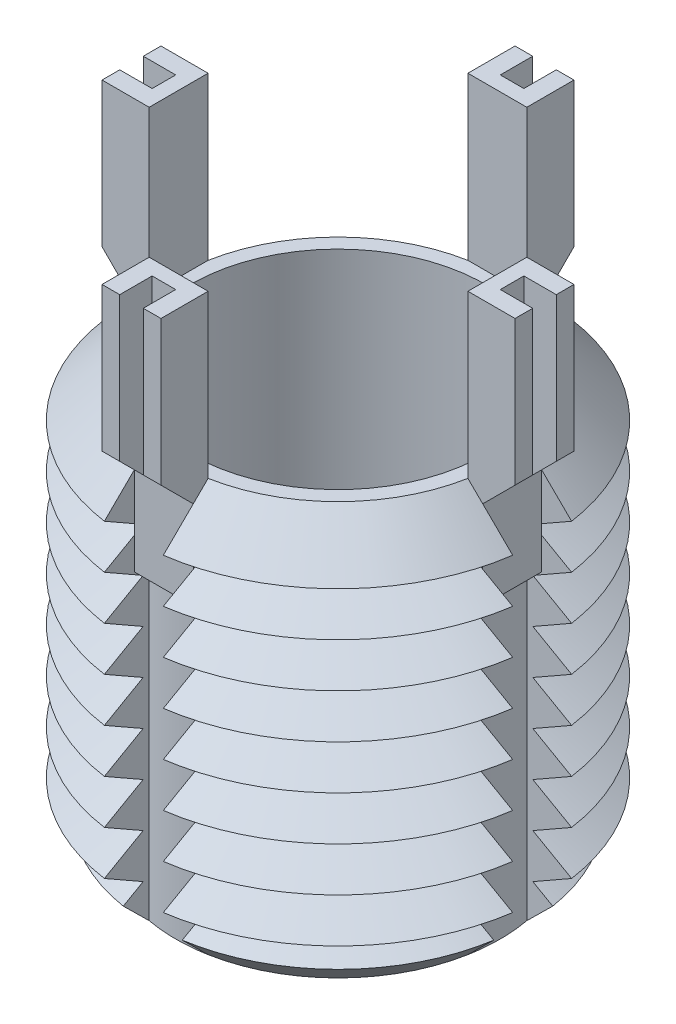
from build123d import *

# Parameters (mm, degrees)
SKETCH1_R               = 7
BOSS_EXTRUDE1_DEPTH     = 14
CHAMFER1_SIZE           = 1.5
LPATTERN1_COUNT         = 8
LPATTERN1_PITCH         = 1.5
CUT_EXTRUDE1_REACH      = 19.146
CIRPATTERN1_COUNT       = 4
BOSS_EXTRUDE3_DEPTH     = 1
CIRPATTERN2_COUNT       = 4
CUT_EXTRUDE3_DEPTH      = 22.874261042
CUT_EXTRUDE3_DEPTH_BACK = 22.874261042
SKETCH6_W               = 1.1
SKETCH6_H               = 0.8
SKETCH6_W_2             = 0.8
SKETCH6_H_2             = 1.1
SKETCH7_R               = 5
CUT_EXTRUDE4_DEPTH      = 14


with BuildPart() as part:
    # Sketch1 → Boss-Extrude1 (new body)
    with BuildSketch(Plane(origin=(0, 0, 0), x_dir=(1, 0, 0), z_dir=(0, 1, 0))):
        with Locations(Location((0, 0, 0), (0, 0, 270))):
            Circle(SKETCH1_R)
    extrude(amount=-BOSS_EXTRUDE1_DEPTH)

    # Chamfer1
    chamfer1_edges = [part.edges().sort_by_distance(p)[0] for p in [
        (0, 0, -7),
        (0, -14, -7),
    ]]
    chamfer(chamfer1_edges, length=CHAMFER1_SIZE)

    # Sketch3 → Cut-Revolve1 (revolve, cut)
    with BuildSketch(Plane(origin=(0, 0, 0), x_dir=(0, 0, -1), z_dir=(1, 0, 0))):
        Polygon((-7, -1.5), (-5.700961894, -2.25), (-7, -3), align=None)
    cut_revolve1 = revolve(axis=Axis((0, 0.885892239, 0), (0, -1, 0)), mode=Mode.SUBTRACT)

    # LPattern1: Cut-Revolve1 ×8
    with Locations(*[(0, -i * LPATTERN1_PITCH, 0) for i in range(1, LPATTERN1_COUNT)]):
        add(cut_revolve1, mode=Mode.SUBTRACT)

    # Cut-Extrude1: up to this cone (the profile starts inside it)
    cut_extrude1_end = Plane(origin=(0, 0, 0), z_dir=(0, 1, 0)).offset(-19.499999) * Cone(1e-06, 58.646, 58.645999, align=(Align.CENTER, Align.CENTER, Align.MIN), mode=Mode.PRIVATE)
    # Sketch4 → Cut-Extrude1 (cut, up to the surface)
    with BuildSketch(Plane(origin=(0, 0, 0), x_dir=(1, 0, 0), z_dir=(0, 1, 0)), mode=Mode.PRIVATE) as cut_extrude1_sk1:
        with BuildLine():
            Line((-5.408326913, 1), (-6.92820323, 1))
            ThreePointArc((-6.92820323, 1), (-7, 0), (-6.92820323, -1))
            Line((-6.92820323, -1), (-5.408326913, -1))
            ThreePointArc((-5.408326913, -1), (-5.5, 0), (-5.408326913, 1))
        make_face()
    cut_extrude1_tool1 = extrude(cut_extrude1_sk1.sketch, amount=-CUT_EXTRUDE1_REACH, mode=Mode.PRIVATE) & cut_extrude1_end
    cut_extrude1 = cut_extrude1_tool1.solids().sort_by_distance((-6.222736, 0, 0))[0]
    add(cut_extrude1, mode=Mode.SUBTRACT)

    # CirPattern1: Cut-Extrude1 ×4 about axis
    cirpattern1_axis = Axis((0, 0, 0), (0, 1, 0))
    for i in range(1, CIRPATTERN1_COUNT):
        add(cut_extrude1.rotate(cirpattern1_axis, i * 360 / CIRPATTERN1_COUNT), mode=Mode.SUBTRACT)

    # Sketch5 → Boss-Extrude3 (add, symmetric)
    with BuildSketch(Plane(origin=(0, 0, 0), x_dir=(0, 0, -1), z_dir=(1, 0, 0))):
        Polygon((-5.408326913, 5.5), (-5.408326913, -3.5), (-5.908326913, -3.5), (-5.908326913, -0.5), (-7.008326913, 0.6), (-7.008326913, 5.5), align=None)
    boss_extrude3 = extrude(amount=BOSS_EXTRUDE3_DEPTH, both=True)

    # CirPattern2: Boss-Extrude3 ×4 about axis
    cirpattern2_axis = Axis((0, 0, 0), (0, 1, 0))
    for i in range(1, CIRPATTERN2_COUNT):
        add(boss_extrude3.rotate(cirpattern2_axis, i * 360 / CIRPATTERN2_COUNT))

    # Sketch6 → Cut-Extrude3 (cut, two sides: drawn at the far end of the back side and taken through both)
    with BuildSketch(Plane(origin=(0, 5.5, 0), x_dir=(1, 0, 0), z_dir=(0, 1, 0)).offset(-CUT_EXTRUDE3_DEPTH_BACK)):
        with Locations((-6.458326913, 0)):
            Rectangle(SKETCH6_W, SKETCH6_H)
        with Locations((0, 6.458326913)):
            Rectangle(SKETCH6_W_2, SKETCH6_H_2)
        with Locations((6.458326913, 0)):
            Rectangle(SKETCH6_W, SKETCH6_H)
        with Locations((0, -6.458326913)):
            Rectangle(SKETCH6_W_2, SKETCH6_H_2)
    extrude(amount=CUT_EXTRUDE3_DEPTH + CUT_EXTRUDE3_DEPTH_BACK, mode=Mode.SUBTRACT)

    # Sketch7 → Cut-Extrude4 (cut)
    with BuildSketch(Plane(origin=(0, 0, 0), x_dir=(1, 0, 0), z_dir=(0, 1, 0))):
        with Locations(Location((0, 0, 0), (0, 0, 270))):
            Circle(SKETCH7_R)
    extrude(amount=-CUT_EXTRUDE4_DEPTH, mode=Mode.SUBTRACT)


solid = part.part
